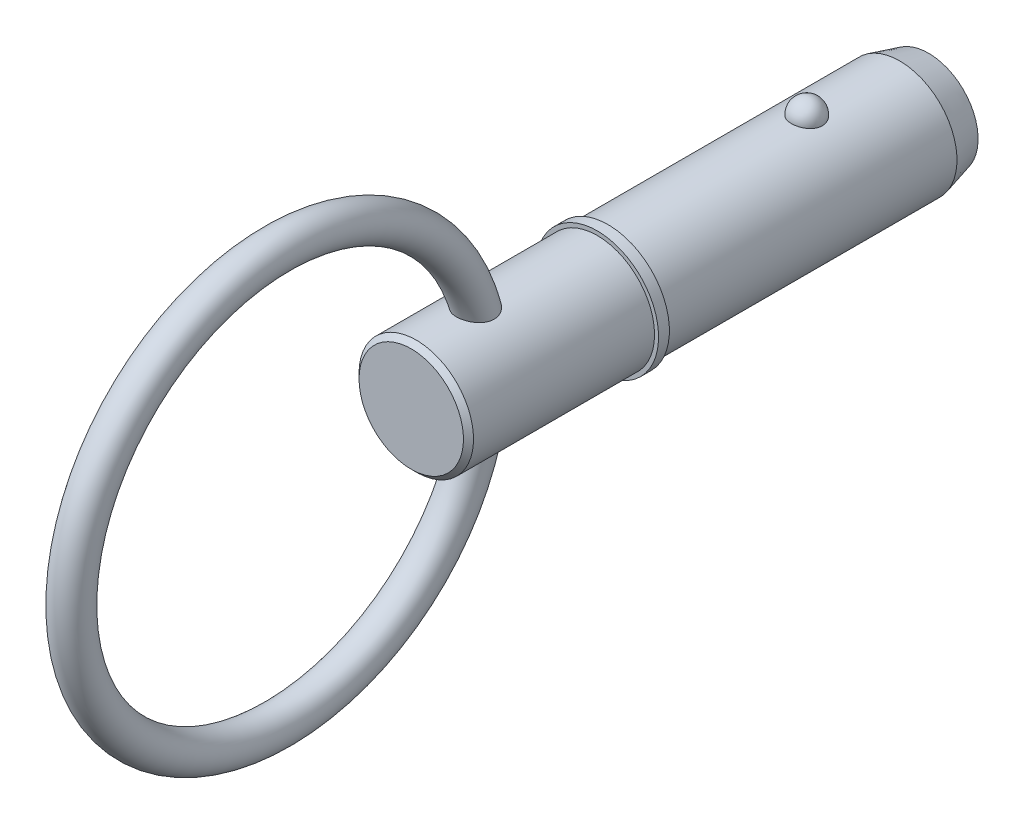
from build123d import *

# Parameters (mm, degrees)
SKETCH2_R           = 7.94
BOSS_EXTRUDE1_DEPTH = 25.4
BOSS_EXTRUDE2_START = 19.05
SKETCH3_R           = 7.94
BOSS_EXTRUDE2_DEPTH = 19.05
CHAMFER1_SIZE       = 4
CHAMFER1_SIZE2      = 1.07179677
SKETCH20_W          = 1.5
SKETCH20_H          = 8.5
SKETCH21_R          = 7.94
BOSS_EXTRUDE3_DEPTH = 27.31
CHAMFER2_SIZE       = 0.7
SKETCH24_R          = 2.5


with BuildPart() as part:
    # Sketch2 → Boss-Extrude1 (new body)
    with BuildSketch(Plane.XY):
        Circle(SKETCH2_R)
    extrude(amount=BOSS_EXTRUDE1_DEPTH)

    # Sketch3 → Boss-Extrude2 (add)
    with BuildSketch(Plane(origin=(0, 0, 0), x_dir=(-1, 0, 0), z_dir=(0, 0, -1)).offset(BOSS_EXTRUDE2_START)):
        Circle(SKETCH3_R)
    extrude(amount=-BOSS_EXTRUDE2_DEPTH)

    # Chamfer1
    chamfer1_edges = [part.edges().sort_by_distance(p)[0] for p in [
        (7.94, 0, -19.05),
    ]]
    chamfer1_side = [part.faces().sort_by_distance(p)[0] for p in [
        (7.94, 0, -9.525),
    ]]
    chamfer(chamfer1_edges, length=CHAMFER1_SIZE, length2=CHAMFER1_SIZE2, reference=chamfer1_side[0])

    # Sketch18 → Revolve1 (revolve)
    with BuildSketch(Plane(origin=(0, 0, 0), x_dir=(0, 0, -1), z_dir=(1, 0, 0))):
        with BuildLine():
            Line((2.15, 10.09), (2.15, 5.79))
            ThreePointArc((2.15, 5.79), (0, 7.94), (2.15, 10.09))
        make_face()
    revolve(axis=Axis((0, 10.09, -2.15), (0, -1, 0)))

    # Sketch20 → Revolve2 (revolve)
    with BuildSketch(Plane(origin=(0, 0, 0), x_dir=(0, 0, -1), z_dir=(1, 0, 0)), mode=Mode.PRIVATE) as revolve2_sk:
        with Locations((-26.15, 4.25)):
            Rectangle(SKETCH20_W, SKETCH20_H)
    revolve(revolve2_sk.sketch.rotate(Axis((0, 0, 33.728787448), (0, 0, 1)), 90), axis=Axis((0, 0, 33.728787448), (0, 0, 1)))

    # Sketch21 → Boss-Extrude3 (add)
    with BuildSketch(Plane(origin=(0, 0, 25.4), x_dir=(-1, 0, 0), z_dir=(0, 0, -1))):
        Circle(SKETCH21_R)
    extrude(amount=-BOSS_EXTRUDE3_DEPTH)

    # Chamfer2
    chamfer2_edges = [part.edges().sort_by_distance(p)[0] for p in [
        (7.94, 0, 52.71),
    ]]
    chamfer(chamfer2_edges, length=CHAMFER2_SIZE)

    # Sweep1: sweep along a path in Sketch23
    with BuildLine(Plane(origin=(0, 0, 0), x_dir=(0, 0, -1), z_dir=(1, 0, 0))) as sweep1_path:
        CenterArc((-71.285, 0), 28.575, 0, 360)
    # Sketch24 → Sweep1 (sweep)
    with BuildSketch(Plane(origin=(0, 0, 0), x_dir=(1, 0, 0), z_dir=(0, 1, 0))):
        with Locations((0, -42.71)):
            Circle(SKETCH24_R)
    sweep(path=sweep1_path.line)


solid = part.part
